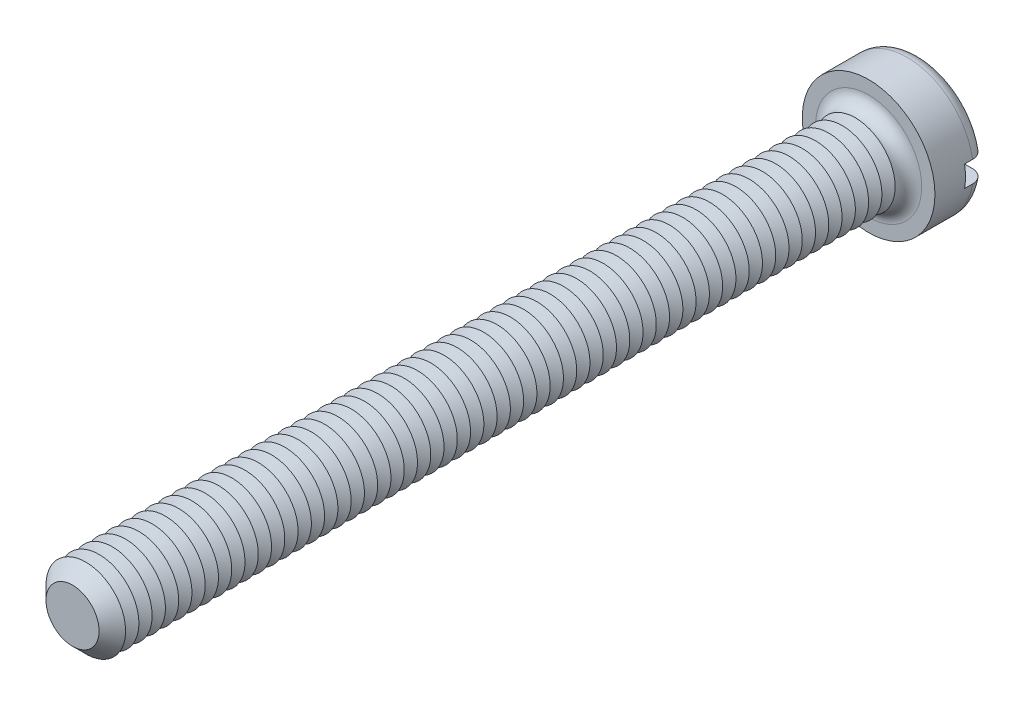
from build123d import *

# Parameters (mm, degrees)
SKETCH3_R           = 5
BOSS_EXTRUDE2_DEPTH = 3.9
SKETCH4_R           = 3
BOSS_EXTRUDE3_DEPTH = 60
FILLET1_R           = 1
CHAMFER1_SIZE       = 1
LPATTERN1_COUNT     = 58
LPATTERN1_PITCH     = 1
SKETCH8_W           = 10
SKETCH8_H           = 1.6
CUT_EXTRUDE1_DEPTH  = 1.6


with BuildPart() as part:
    # Sketch3 → Boss-Extrude2 (new body)
    with BuildSketch(Plane.XY):
        Circle(SKETCH3_R)
    extrude(amount=-BOSS_EXTRUDE2_DEPTH)

    # Sketch4 → Boss-Extrude3 (add)
    with BuildSketch(Plane.XY):
        Circle(SKETCH4_R)
    extrude(amount=BOSS_EXTRUDE3_DEPTH)

    # Fillet1
    fillet1_edges = [part.edges().sort_by_distance(p)[0] for p in [
        (-5, 0, -3.9),
        (-3, 0, 0),
    ]]
    fillet(fillet1_edges, radius=FILLET1_R)

    # Chamfer1
    chamfer1_edges = [part.edges().sort_by_distance(p)[0] for p in [
        (-3, 0, 60),
    ]]
    chamfer(chamfer1_edges, length=CHAMFER1_SIZE)

    # Sketch6 → Cut-Revolve1 (revolve, cut)
    with BuildSketch(Plane(origin=(0, 0, 0), x_dir=(0, 0, -1), z_dir=(1, 0, 0)), mode=Mode.PRIVATE) as cut_revolve1_sk:
        Polygon((-1, 3), (-1.5, 2.133974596), (-2, 3), align=None)
    cut_revolve1 = revolve(cut_revolve1_sk.sketch.rotate(Axis((0, 0, -1.694361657), (0, 0, 1)), 90), axis=Axis((0, 0, -1.694361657), (0, 0, 1)), mode=Mode.SUBTRACT)

    # LPattern1: Cut-Revolve1 ×58
    with Locations(*[(0, 0, i * LPATTERN1_PITCH) for i in range(1, LPATTERN1_COUNT)]):
        add(cut_revolve1, mode=Mode.SUBTRACT)

    # Sketch8 → Cut-Extrude1 (cut)
    with BuildSketch(Plane(origin=(0, 0, -3.9), x_dir=(-1, 0, 0), z_dir=(0, 0, -1))):
        Rectangle(SKETCH8_W, SKETCH8_H)
    extrude(amount=-CUT_EXTRUDE1_DEPTH, mode=Mode.SUBTRACT)


solid = part.part
